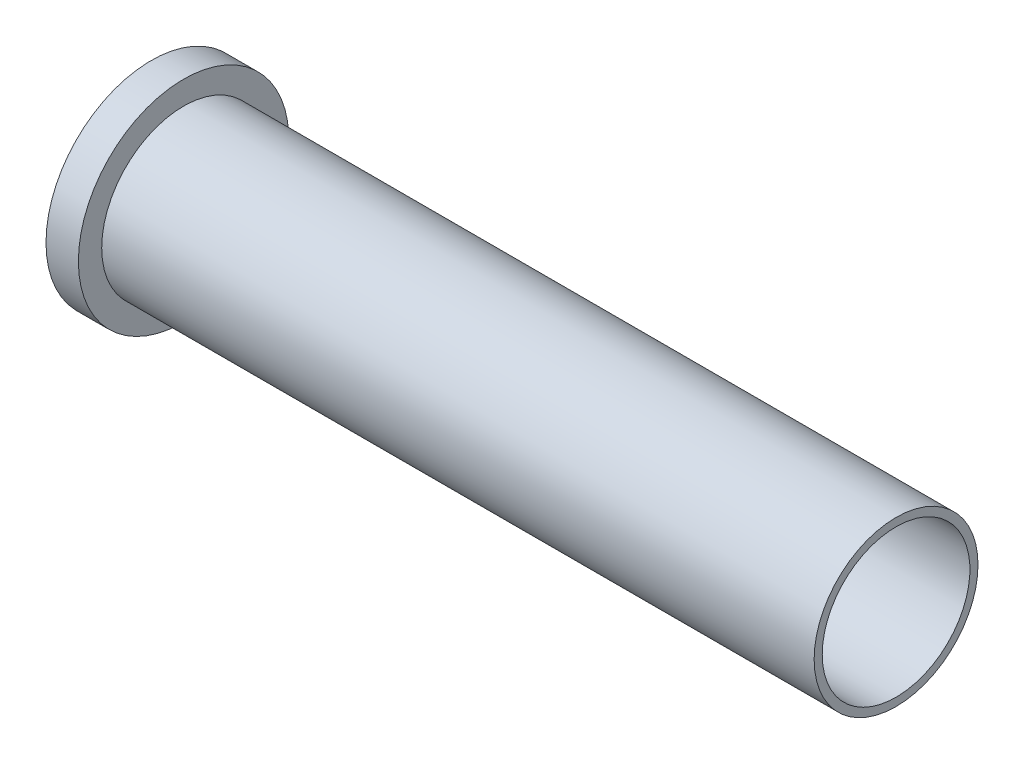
ISO-10303-21;
HEADER;
FILE_DESCRIPTION(('STEP AP214'),'2;1');
FILE_NAME('part.step','',(''),(''),'','','');
FILE_SCHEMA(('AUTOMOTIVE_DESIGN { 1 0 10303 214 1 1 1 1 }'));
ENDSEC;
DATA;
#1=APPLICATION_CONTEXT('core data for automotive mechanical design processes');
#2=APPLICATION_PROTOCOL_DEFINITION('international standard','automotive_design',2000,#1);
#3=PRODUCT_CONTEXT('',#1,'mechanical');
#4=PRODUCT('Part','Part','',(#3));
#5=PRODUCT_RELATED_PRODUCT_CATEGORY('part','',(#4));
#6=PRODUCT_DEFINITION_FORMATION('','',#4);
#7=PRODUCT_DEFINITION_CONTEXT('part definition',#1,'design');
#8=PRODUCT_DEFINITION('design','',#6,#7);
#9=PRODUCT_DEFINITION_SHAPE('','',#8);
#10=(LENGTH_UNIT() NAMED_UNIT(*) SI_UNIT(.MILLI.,.METRE.));
#11=(NAMED_UNIT(*) PLANE_ANGLE_UNIT() SI_UNIT($,.RADIAN.));
#12=(NAMED_UNIT(*) SI_UNIT($,.STERADIAN.) SOLID_ANGLE_UNIT());
#13=UNCERTAINTY_MEASURE_WITH_UNIT(LENGTH_MEASURE(1.E-05),#10,'distance_accuracy_value','');
#14=(GEOMETRIC_REPRESENTATION_CONTEXT(3) GLOBAL_UNCERTAINTY_ASSIGNED_CONTEXT((#13)) GLOBAL_UNIT_ASSIGNED_CONTEXT((#10,
#11,#12)) REPRESENTATION_CONTEXT('',''));
#15=CARTESIAN_POINT('',(0.,0.,0.));
#16=DIRECTION('',(0.,0.,1.));
#17=DIRECTION('',(1.,0.,0.));
#18=AXIS2_PLACEMENT_3D('',#15,#16,#17);
#19=CARTESIAN_POINT('',(139.7,0.,0.));
#20=DIRECTION('',(-1.,0.,0.));
#21=DIRECTION('',(0.,0.,1.));
#22=AXIS2_PLACEMENT_3D('',#19,#20,#21);
#23=CYLINDRICAL_SURFACE('',#22,16.0655);
#24=CARTESIAN_POINT('',(139.7,0.,0.));
#25=DIRECTION('',(1.,0.,0.));
#26=DIRECTION('',(0.,0.,-1.));
#27=AXIS2_PLACEMENT_3D('',#24,#25,#26);
#28=CIRCLE('',#27,16.0655);
#29=CARTESIAN_POINT('',(139.7,0.,-16.0655));
#30=VERTEX_POINT('',#29);
#31=EDGE_CURVE('E10',#30,#30,#28,.T.);
#32=ORIENTED_EDGE('',*,*,#31,.F.);
#33=EDGE_LOOP('',(#32));
#34=FACE_BOUND('',#33,.T.);
#35=CARTESIAN_POINT('',(0.,0.,0.));
#36=DIRECTION('',(-1.,0.,0.));
#37=DIRECTION('',(0.,0.,1.));
#38=AXIS2_PLACEMENT_3D('',#35,#36,#37);
#39=CIRCLE('',#38,16.0655);
#40=CARTESIAN_POINT('',(0.,0.,16.0655));
#41=VERTEX_POINT('',#40);
#42=EDGE_CURVE('E35',#41,#41,#39,.T.);
#43=ORIENTED_EDGE('',*,*,#42,.F.);
#44=EDGE_LOOP('',(#43));
#45=FACE_BOUND('',#44,.T.);
#46=ADVANCED_FACE('F29',(#34,#45),#23,.T.);
#47=CARTESIAN_POINT('',(139.7,0.,0.));
#48=DIRECTION('',(1.,0.,0.));
#49=DIRECTION('',(0.,0.,-1.));
#50=AXIS2_PLACEMENT_3D('',#47,#48,#49);
#51=PLANE('',#50);
#52=CARTESIAN_POINT('',(139.7,0.,0.));
#53=DIRECTION('',(-1.,0.,0.));
#54=DIRECTION('',(0.,0.,1.));
#55=AXIS2_PLACEMENT_3D('',#52,#53,#54);
#56=CIRCLE('',#55,14.478);
#57=CARTESIAN_POINT('',(139.7,0.,14.478));
#58=VERTEX_POINT('',#57);
#59=EDGE_CURVE('E48',#58,#58,#56,.T.);
#60=ORIENTED_EDGE('',*,*,#59,.T.);
#61=EDGE_LOOP('',(#60));
#62=FACE_BOUND('',#61,.T.);
#63=ORIENTED_EDGE('',*,*,#31,.T.);
#64=EDGE_LOOP('',(#63));
#65=FACE_BOUND('',#64,.T.);
#66=ADVANCED_FACE('F71',(#62,#65),#51,.T.);
#67=CARTESIAN_POINT('',(0.,0.,0.));
#68=DIRECTION('',(-1.,0.,0.));
#69=DIRECTION('',(0.,0.,1.));
#70=AXIS2_PLACEMENT_3D('',#67,#68,#69);
#71=PLANE('',#70);
#72=CARTESIAN_POINT('',(0.,0.,0.));
#73=DIRECTION('',(-1.,0.,0.));
#74=DIRECTION('',(0.,0.,1.));
#75=AXIS2_PLACEMENT_3D('',#72,#73,#74);
#76=CIRCLE('',#75,20.6375);
#77=CARTESIAN_POINT('',(0.,0.,20.6375));
#78=VERTEX_POINT('',#77);
#79=EDGE_CURVE('E43',#78,#78,#76,.T.);
#80=ORIENTED_EDGE('',*,*,#79,.F.);
#81=EDGE_LOOP('',(#80));
#82=FACE_BOUND('',#81,.T.);
#83=ORIENTED_EDGE('',*,*,#42,.T.);
#84=EDGE_LOOP('',(#83));
#85=FACE_BOUND('',#84,.T.);
#86=ADVANCED_FACE('F66',(#82,#85),#71,.F.);
#87=CARTESIAN_POINT('',(-6.35,0.,0.));
#88=DIRECTION('',(1.,0.,0.));
#89=DIRECTION('',(0.,0.,-1.));
#90=AXIS2_PLACEMENT_3D('',#87,#88,#89);
#91=CYLINDRICAL_SURFACE('',#90,20.6375);
#92=CARTESIAN_POINT('',(-6.35,0.,0.));
#93=DIRECTION('',(-1.,0.,0.));
#94=DIRECTION('',(0.,0.,1.));
#95=AXIS2_PLACEMENT_3D('',#92,#93,#94);
#96=CIRCLE('',#95,20.6375);
#97=CARTESIAN_POINT('',(-6.35,0.,20.6375));
#98=VERTEX_POINT('',#97);
#99=EDGE_CURVE('E39',#98,#98,#96,.T.);
#100=ORIENTED_EDGE('',*,*,#99,.F.);
#101=EDGE_LOOP('',(#100));
#102=FACE_BOUND('',#101,.T.);
#103=ORIENTED_EDGE('',*,*,#79,.T.);
#104=EDGE_LOOP('',(#103));
#105=FACE_BOUND('',#104,.T.);
#106=ADVANCED_FACE('F60',(#102,#105),#91,.T.);
#107=CARTESIAN_POINT('',(-6.35,0.,0.));
#108=DIRECTION('',(-1.,0.,0.));
#109=DIRECTION('',(0.,0.,1.));
#110=AXIS2_PLACEMENT_3D('',#107,#108,#109);
#111=PLANE('',#110);
#112=CARTESIAN_POINT('',(-6.35,0.,0.));
#113=DIRECTION('',(-1.,0.,0.));
#114=DIRECTION('',(0.,0.,1.));
#115=AXIS2_PLACEMENT_3D('',#112,#113,#114);
#116=CIRCLE('',#115,14.478);
#117=CARTESIAN_POINT('',(-6.35,0.,14.478));
#118=VERTEX_POINT('',#117);
#119=EDGE_CURVE('E51',#118,#118,#116,.T.);
#120=ORIENTED_EDGE('',*,*,#119,.F.);
#121=EDGE_LOOP('',(#120));
#122=FACE_BOUND('',#121,.T.);
#123=ORIENTED_EDGE('',*,*,#99,.T.);
#124=EDGE_LOOP('',(#123));
#125=FACE_BOUND('',#124,.T.);
#126=ADVANCED_FACE('F57',(#122,#125),#111,.T.);
#127=CARTESIAN_POINT('',(139.7,0.,0.));
#128=DIRECTION('',(-1.,0.,0.));
#129=DIRECTION('',(0.,0.,1.));
#130=AXIS2_PLACEMENT_3D('',#127,#128,#129);
#131=CYLINDRICAL_SURFACE('',#130,14.478);
#132=ORIENTED_EDGE('',*,*,#59,.F.);
#133=EDGE_LOOP('',(#132));
#134=FACE_BOUND('',#133,.T.);
#135=ORIENTED_EDGE('',*,*,#119,.T.);
#136=EDGE_LOOP('',(#135));
#137=FACE_BOUND('',#136,.T.);
#138=ADVANCED_FACE('F55',(#134,#137),#131,.F.);
#139=CLOSED_SHELL('',(#46,#66,#86,#106,#126,#138));
#140=MANIFOLD_SOLID_BREP('B2',#139);
#141=ADVANCED_BREP_SHAPE_REPRESENTATION('',(#18,#140),#14);
#142=SHAPE_DEFINITION_REPRESENTATION(#9,#141);
ENDSEC;
END-ISO-10303-21;
